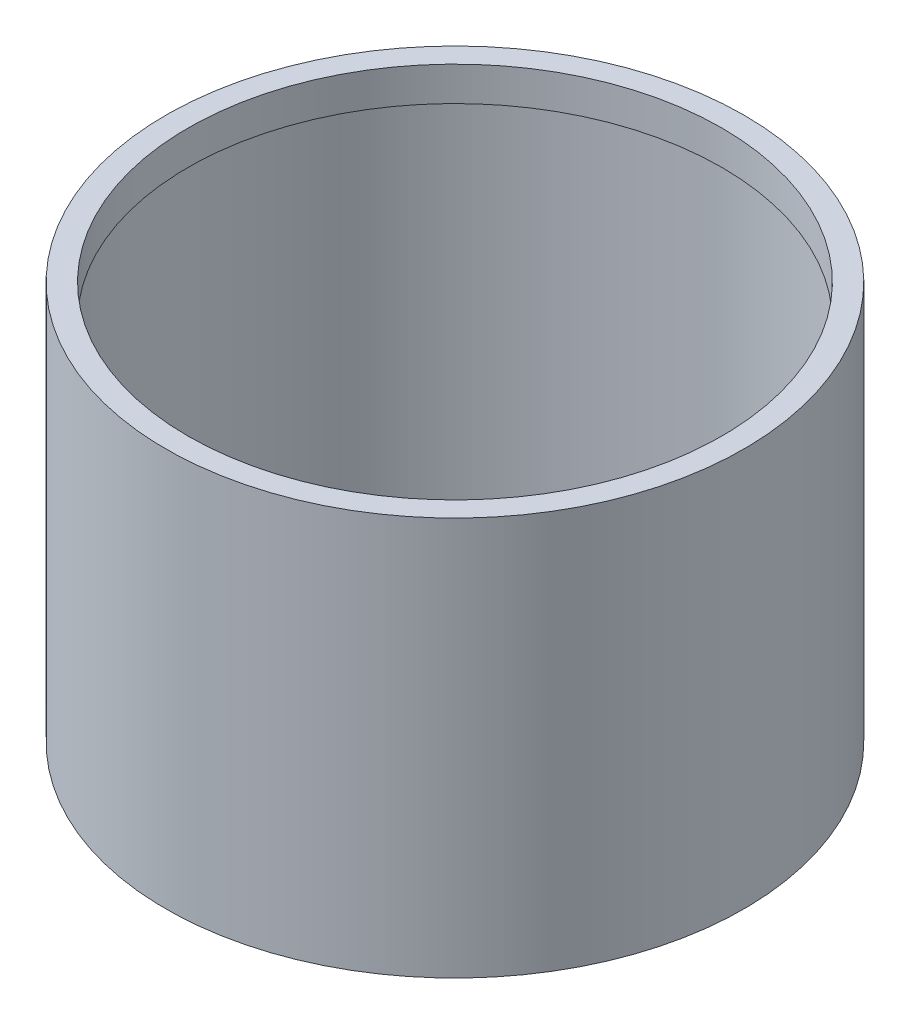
ISO-10303-21;
HEADER;
FILE_DESCRIPTION(('STEP AP214'),'2;1');
FILE_NAME('part.step','',(''),(''),'','','');
FILE_SCHEMA(('AUTOMOTIVE_DESIGN { 1 0 10303 214 1 1 1 1 }'));
ENDSEC;
DATA;
#1=APPLICATION_CONTEXT('core data for automotive mechanical design processes');
#2=APPLICATION_PROTOCOL_DEFINITION('international standard','automotive_design',2000,#1);
#3=PRODUCT_CONTEXT('',#1,'mechanical');
#4=PRODUCT('Part','Part','',(#3));
#5=PRODUCT_RELATED_PRODUCT_CATEGORY('part','',(#4));
#6=PRODUCT_DEFINITION_FORMATION('','',#4);
#7=PRODUCT_DEFINITION_CONTEXT('part definition',#1,'design');
#8=PRODUCT_DEFINITION('design','',#6,#7);
#9=PRODUCT_DEFINITION_SHAPE('','',#8);
#10=(LENGTH_UNIT() NAMED_UNIT(*) SI_UNIT(.MILLI.,.METRE.));
#11=(NAMED_UNIT(*) PLANE_ANGLE_UNIT() SI_UNIT($,.RADIAN.));
#12=(NAMED_UNIT(*) SI_UNIT($,.STERADIAN.) SOLID_ANGLE_UNIT());
#13=UNCERTAINTY_MEASURE_WITH_UNIT(LENGTH_MEASURE(1.E-05),#10,'distance_accuracy_value','');
#14=(GEOMETRIC_REPRESENTATION_CONTEXT(3) GLOBAL_UNCERTAINTY_ASSIGNED_CONTEXT((#13)) GLOBAL_UNIT_ASSIGNED_CONTEXT((#10,
#11,#12)) REPRESENTATION_CONTEXT('',''));
#15=CARTESIAN_POINT('',(0.,0.,0.));
#16=DIRECTION('',(0.,0.,1.));
#17=DIRECTION('',(1.,0.,0.));
#18=AXIS2_PLACEMENT_3D('',#15,#16,#17);
#19=CARTESIAN_POINT('',(0.,0.,0.));
#20=DIRECTION('',(0.,-1.,0.));
#21=DIRECTION('',(0.,0.,-1.00000000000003));
#22=AXIS2_PLACEMENT_3D('',#19,#20,#21);
#23=CYLINDRICAL_SURFACE('',#22,50.8);
#24=CARTESIAN_POINT('',(0.,-70.0000000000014,0.));
#25=DIRECTION('',(0.,-1.,0.));
#26=DIRECTION('',(0.,0.,-1.00000000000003));
#27=AXIS2_PLACEMENT_3D('',#24,#25,#26);
#28=CIRCLE('',#27,50.8);
#29=CARTESIAN_POINT('',(0.,-70.0000000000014,-50.8000000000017));
#30=VERTEX_POINT('',#29);
#31=EDGE_CURVE('E36',#30,#30,#28,.T.);
#32=ORIENTED_EDGE('',*,*,#31,.F.);
#33=EDGE_LOOP('',(#32));
#34=FACE_BOUND('',#33,.T.);
#35=CARTESIAN_POINT('',(0.,0.,0.));
#36=DIRECTION('',(0.,-1.,0.));
#37=DIRECTION('',(0.,0.,-1.00000000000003));
#38=AXIS2_PLACEMENT_3D('',#35,#36,#37);
#39=CIRCLE('',#38,50.8);
#40=CARTESIAN_POINT('',(0.,0.,-50.8000000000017));
#41=VERTEX_POINT('',#40);
#42=EDGE_CURVE('E10',#41,#41,#39,.T.);
#43=ORIENTED_EDGE('',*,*,#42,.T.);
#44=EDGE_LOOP('',(#43));
#45=FACE_BOUND('',#44,.T.);
#46=ADVANCED_FACE('F14',(#34,#45),#23,.T.);
#47=CARTESIAN_POINT('',(-50.8000000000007,-2.83106871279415E-12,-2.63677968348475E-13));
#48=DIRECTION('',(0.,-1.,0.));
#49=DIRECTION('',(0.,0.,-1.00000000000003));
#50=AXIS2_PLACEMENT_3D('',#47,#48,#49);
#51=PLANE('',#50);
#52=ORIENTED_EDGE('',*,*,#42,.F.);
#53=EDGE_LOOP('',(#52));
#54=FACE_BOUND('',#53,.T.);
#55=CARTESIAN_POINT('',(0.,0.,0.));
#56=DIRECTION('',(0.,-1.,0.));
#57=DIRECTION('',(0.,0.,-1.00000000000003));
#58=AXIS2_PLACEMENT_3D('',#55,#56,#57);
#59=CIRCLE('',#58,46.9);
#60=CARTESIAN_POINT('',(0.,0.,-46.9000000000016));
#61=VERTEX_POINT('',#60);
#62=EDGE_CURVE('E20',#61,#61,#59,.T.);
#63=ORIENTED_EDGE('',*,*,#62,.T.);
#64=EDGE_LOOP('',(#63));
#65=FACE_BOUND('',#64,.T.);
#66=ADVANCED_FACE('F43',(#54,#65),#51,.F.);
#67=CARTESIAN_POINT('',(0.,0.,0.));
#68=DIRECTION('',(0.,-1.,0.));
#69=DIRECTION('',(0.,0.,-1.00000000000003));
#70=AXIS2_PLACEMENT_3D('',#67,#68,#69);
#71=CYLINDRICAL_SURFACE('',#70,46.9);
#72=ORIENTED_EDGE('',*,*,#62,.F.);
#73=EDGE_LOOP('',(#72));
#74=FACE_BOUND('',#73,.T.);
#75=CARTESIAN_POINT('',(0.,-6.,0.));
#76=DIRECTION('',(0.,-1.,0.));
#77=DIRECTION('',(0.,0.,-1.00000000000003));
#78=AXIS2_PLACEMENT_3D('',#75,#76,#77);
#79=CIRCLE('',#78,46.9);
#80=CARTESIAN_POINT('',(0.,-6.,-46.9000000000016));
#81=VERTEX_POINT('',#80);
#82=EDGE_CURVE('E24',#81,#81,#79,.T.);
#83=ORIENTED_EDGE('',*,*,#82,.T.);
#84=EDGE_LOOP('',(#83));
#85=FACE_BOUND('',#84,.T.);
#86=ADVANCED_FACE('F49',(#74,#85),#71,.F.);
#87=CARTESIAN_POINT('',(-46.9,-6.00000000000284,0.));
#88=DIRECTION('',(0.,1.,0.));
#89=DIRECTION('',(0.,0.,1.00000000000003));
#90=AXIS2_PLACEMENT_3D('',#87,#88,#89);
#91=PLANE('',#90);
#92=ORIENTED_EDGE('',*,*,#82,.F.);
#93=EDGE_LOOP('',(#92));
#94=FACE_BOUND('',#93,.T.);
#95=CARTESIAN_POINT('',(0.,-6.,0.));
#96=DIRECTION('',(0.,-1.,0.));
#97=DIRECTION('',(0.,0.,-1.00000000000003));
#98=AXIS2_PLACEMENT_3D('',#95,#96,#97);
#99=CIRCLE('',#98,48.75);
#100=CARTESIAN_POINT('',(0.,-6.,-48.7500000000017));
#101=VERTEX_POINT('',#100);
#102=EDGE_CURVE('E28',#101,#101,#99,.T.);
#103=ORIENTED_EDGE('',*,*,#102,.T.);
#104=EDGE_LOOP('',(#103));
#105=FACE_BOUND('',#104,.T.);
#106=ADVANCED_FACE('F55',(#94,#105),#91,.F.);
#107=CARTESIAN_POINT('',(0.,0.,0.));
#108=DIRECTION('',(0.,-1.,0.));
#109=DIRECTION('',(0.,0.,-1.00000000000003));
#110=AXIS2_PLACEMENT_3D('',#107,#108,#109);
#111=CYLINDRICAL_SURFACE('',#110,48.75);
#112=ORIENTED_EDGE('',*,*,#102,.F.);
#113=EDGE_LOOP('',(#112));
#114=FACE_BOUND('',#113,.T.);
#115=CARTESIAN_POINT('',(0.,-70.0000000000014,0.));
#116=DIRECTION('',(0.,-1.,0.));
#117=DIRECTION('',(0.,0.,-1.00000000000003));
#118=AXIS2_PLACEMENT_3D('',#115,#116,#117);
#119=CIRCLE('',#118,48.75);
#120=CARTESIAN_POINT('',(0.,-70.0000000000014,-48.7500000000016));
#121=VERTEX_POINT('',#120);
#122=EDGE_CURVE('E33',#121,#121,#119,.T.);
#123=ORIENTED_EDGE('',*,*,#122,.T.);
#124=EDGE_LOOP('',(#123));
#125=FACE_BOUND('',#124,.T.);
#126=ADVANCED_FACE('F61',(#114,#125),#111,.F.);
#127=CARTESIAN_POINT('',(-48.75,-70.0000000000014,0.));
#128=DIRECTION('',(0.,1.,0.));
#129=DIRECTION('',(0.,0.,1.00000000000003));
#130=AXIS2_PLACEMENT_3D('',#127,#128,#129);
#131=PLANE('',#130);
#132=ORIENTED_EDGE('',*,*,#122,.F.);
#133=EDGE_LOOP('',(#132));
#134=FACE_BOUND('',#133,.T.);
#135=ORIENTED_EDGE('',*,*,#31,.T.);
#136=EDGE_LOOP('',(#135));
#137=FACE_BOUND('',#136,.T.);
#138=ADVANCED_FACE('F40',(#134,#137),#131,.F.);
#139=CLOSED_SHELL('',(#46,#66,#86,#106,#126,#138));
#140=MANIFOLD_SOLID_BREP('B1',#139);
#141=ADVANCED_BREP_SHAPE_REPRESENTATION('',(#18,#140),#14);
#142=SHAPE_DEFINITION_REPRESENTATION(#9,#141);
ENDSEC;
END-ISO-10303-21;
